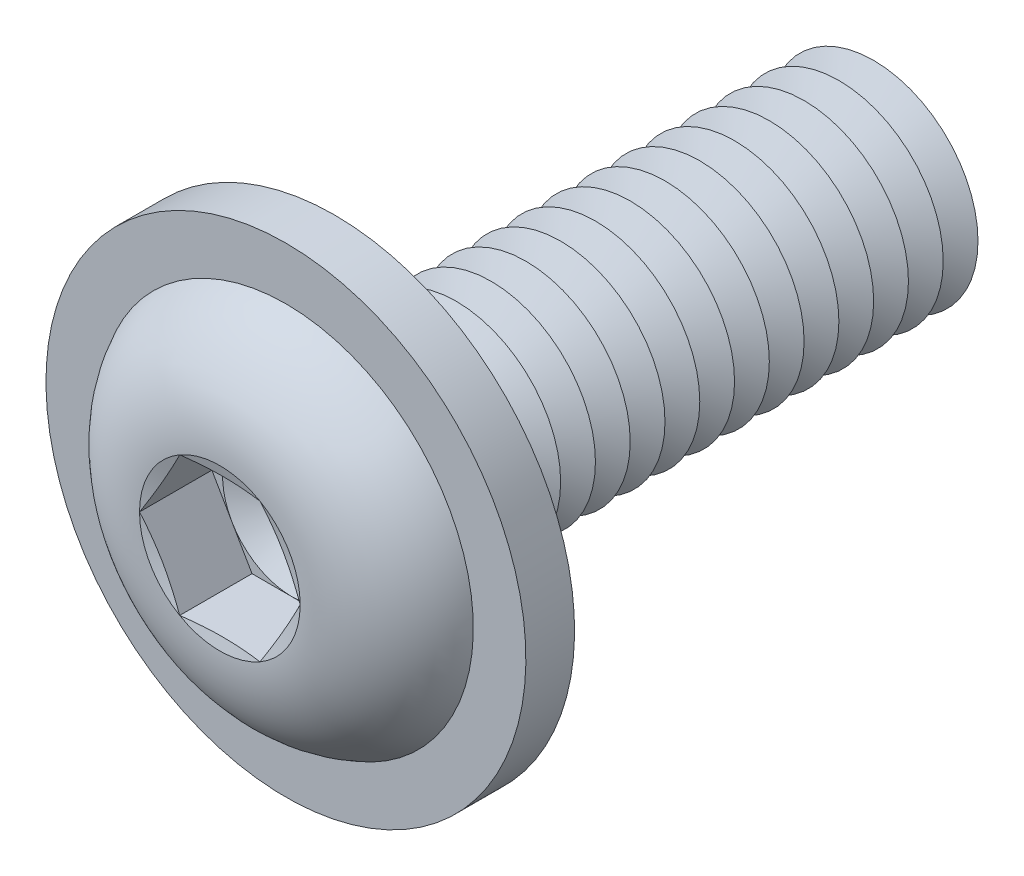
ISO-10303-21;
HEADER;
FILE_DESCRIPTION(('STEP AP214'),'2;1');
FILE_NAME('part.step','',(''),(''),'','','');
FILE_SCHEMA(('AUTOMOTIVE_DESIGN { 1 0 10303 214 1 1 1 1 }'));
ENDSEC;
DATA;
#1=APPLICATION_CONTEXT('core data for automotive mechanical design processes');
#2=APPLICATION_PROTOCOL_DEFINITION('international standard','automotive_design',2000,#1);
#3=PRODUCT_CONTEXT('',#1,'mechanical');
#4=PRODUCT('Part','Part','',(#3));
#5=PRODUCT_RELATED_PRODUCT_CATEGORY('part','',(#4));
#6=PRODUCT_DEFINITION_FORMATION('','',#4);
#7=PRODUCT_DEFINITION_CONTEXT('part definition',#1,'design');
#8=PRODUCT_DEFINITION('design','',#6,#7);
#9=PRODUCT_DEFINITION_SHAPE('','',#8);
#10=(LENGTH_UNIT() NAMED_UNIT(*) SI_UNIT(.MILLI.,.METRE.));
#11=(NAMED_UNIT(*) PLANE_ANGLE_UNIT() SI_UNIT($,.RADIAN.));
#12=(NAMED_UNIT(*) SI_UNIT($,.STERADIAN.) SOLID_ANGLE_UNIT());
#13=UNCERTAINTY_MEASURE_WITH_UNIT(LENGTH_MEASURE(1.E-05),#10,'distance_accuracy_value','');
#14=(GEOMETRIC_REPRESENTATION_CONTEXT(3) GLOBAL_UNCERTAINTY_ASSIGNED_CONTEXT((#13)) GLOBAL_UNIT_ASSIGNED_CONTEXT((#10,
#11,#12)) REPRESENTATION_CONTEXT('',''));
#15=CARTESIAN_POINT('',(0.,0.,0.));
#16=DIRECTION('',(0.,0.,1.));
#17=DIRECTION('',(1.,0.,0.));
#18=AXIS2_PLACEMENT_3D('',#15,#16,#17);
#19=CARTESIAN_POINT('',(0.,0.,-6.25));
#20=DIRECTION('',(0.,0.,1.));
#21=DIRECTION('',(1.,0.,0.));
#22=AXIS2_PLACEMENT_3D('',#19,#20,#21);
#23=CONICAL_SURFACE('',#22,1.5,1.0471975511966);
#24=CARTESIAN_POINT('',(0.,0.,-6.5));
#25=DIRECTION('',(0.,0.,1.));
#26=DIRECTION('',(1.,0.,0.));
#27=AXIS2_PLACEMENT_3D('',#24,#25,#26);
#28=CIRCLE('',#27,1.06698729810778);
#29=CARTESIAN_POINT('',(1.06698729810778,0.,-6.5));
#30=VERTEX_POINT('',#29);
#31=EDGE_CURVE('E339',#30,#30,#28,.T.);
#32=ORIENTED_EDGE('',*,*,#31,.T.);
#33=EDGE_LOOP('',(#32));
#34=FACE_BOUND('',#33,.T.);
#35=CARTESIAN_POINT('',(0.,0.,-6.25));
#36=DIRECTION('',(0.,0.,1.));
#37=DIRECTION('',(1.,0.,0.));
#38=AXIS2_PLACEMENT_3D('',#35,#36,#37);
#39=CIRCLE('',#38,1.5);
#40=CARTESIAN_POINT('',(1.5,0.,-6.25));
#41=VERTEX_POINT('',#40);
#42=EDGE_CURVE('E335',#41,#41,#39,.T.);
#43=ORIENTED_EDGE('',*,*,#42,.F.);
#44=EDGE_LOOP('',(#43));
#45=FACE_BOUND('',#44,.T.);
#46=ADVANCED_FACE('F39',(#34,#45),#23,.T.);
#47=CARTESIAN_POINT('',(0.,0.,-6.5));
#48=DIRECTION('',(0.,0.,-1.));
#49=DIRECTION('',(-1.,0.,0.));
#50=AXIS2_PLACEMENT_3D('',#47,#48,#49);
#51=CONICAL_SURFACE('',#50,1.06698729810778,1.0471975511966);
#52=CARTESIAN_POINT('',(0.,0.,-6.75));
#53=DIRECTION('',(0.,0.,1.));
#54=DIRECTION('',(1.,0.,0.));
#55=AXIS2_PLACEMENT_3D('',#52,#53,#54);
#56=CIRCLE('',#55,1.5);
#57=CARTESIAN_POINT('',(1.5,0.,-6.75));
#58=VERTEX_POINT('',#57);
#59=EDGE_CURVE('E343',#58,#58,#56,.T.);
#60=ORIENTED_EDGE('',*,*,#59,.T.);
#61=EDGE_LOOP('',(#60));
#62=FACE_BOUND('',#61,.T.);
#63=ORIENTED_EDGE('',*,*,#31,.F.);
#64=EDGE_LOOP('',(#63));
#65=FACE_BOUND('',#64,.T.);
#66=ADVANCED_FACE('F464',(#62,#65),#51,.T.);
#67=CARTESIAN_POINT('',(0.,1.5,-8.));
#68=DIRECTION('',(0.,0.,-1.));
#69=DIRECTION('',(-1.,0.,0.));
#70=AXIS2_PLACEMENT_3D('',#67,#68,#69);
#71=PLANE('',#70);
#72=CARTESIAN_POINT('',(0.,0.,-8.));
#73=DIRECTION('',(0.,0.,1.));
#74=DIRECTION('',(1.,0.,0.));
#75=AXIS2_PLACEMENT_3D('',#72,#73,#74);
#76=CIRCLE('',#75,1.06698729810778);
#77=CARTESIAN_POINT('',(1.06698729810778,0.,-8.));
#78=VERTEX_POINT('',#77);
#79=EDGE_CURVE('E363',#78,#78,#76,.T.);
#80=ORIENTED_EDGE('',*,*,#79,.F.);
#81=EDGE_LOOP('',(#80));
#82=FACE_BOUND('',#81,.T.);
#83=ADVANCED_FACE('F470',(#82),#71,.T.);
#84=CARTESIAN_POINT('',(0.,0.,-7.75));
#85=DIRECTION('',(0.,0.,1.));
#86=DIRECTION('',(1.,0.,0.));
#87=AXIS2_PLACEMENT_3D('',#84,#85,#86);
#88=CONICAL_SURFACE('',#87,1.5,1.0471975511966);
#89=ORIENTED_EDGE('',*,*,#79,.T.);
#90=EDGE_LOOP('',(#89));
#91=FACE_BOUND('',#90,.T.);
#92=CARTESIAN_POINT('',(0.,0.,-7.75));
#93=DIRECTION('',(0.,0.,1.));
#94=DIRECTION('',(1.,0.,0.));
#95=AXIS2_PLACEMENT_3D('',#92,#93,#94);
#96=CIRCLE('',#95,1.5);
#97=CARTESIAN_POINT('',(1.5,0.,-7.75));
#98=VERTEX_POINT('',#97);
#99=EDGE_CURVE('E359',#98,#98,#96,.T.);
#100=ORIENTED_EDGE('',*,*,#99,.F.);
#101=EDGE_LOOP('',(#100));
#102=FACE_BOUND('',#101,.T.);
#103=ADVANCED_FACE('F489',(#91,#102),#88,.T.);
#104=CARTESIAN_POINT('',(0.,0.,-7.5));
#105=DIRECTION('',(0.,0.,-1.));
#106=DIRECTION('',(-1.,0.,0.));
#107=AXIS2_PLACEMENT_3D('',#104,#105,#106);
#108=CONICAL_SURFACE('',#107,1.06698729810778,1.0471975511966);
#109=ORIENTED_EDGE('',*,*,#99,.T.);
#110=EDGE_LOOP('',(#109));
#111=FACE_BOUND('',#110,.T.);
#112=CARTESIAN_POINT('',(0.,0.,-7.5));
#113=DIRECTION('',(0.,0.,1.));
#114=DIRECTION('',(1.,0.,0.));
#115=AXIS2_PLACEMENT_3D('',#112,#113,#114);
#116=CIRCLE('',#115,1.06698729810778);
#117=CARTESIAN_POINT('',(1.06698729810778,0.,-7.5));
#118=VERTEX_POINT('',#117);
#119=EDGE_CURVE('E355',#118,#118,#116,.T.);
#120=ORIENTED_EDGE('',*,*,#119,.F.);
#121=EDGE_LOOP('',(#120));
#122=FACE_BOUND('',#121,.T.);
#123=ADVANCED_FACE('F486',(#111,#122),#108,.T.);
#124=CARTESIAN_POINT('',(0.,0.,-7.25));
#125=DIRECTION('',(0.,0.,1.));
#126=DIRECTION('',(1.,0.,0.));
#127=AXIS2_PLACEMENT_3D('',#124,#125,#126);
#128=CONICAL_SURFACE('',#127,1.5,1.0471975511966);
#129=ORIENTED_EDGE('',*,*,#119,.T.);
#130=EDGE_LOOP('',(#129));
#131=FACE_BOUND('',#130,.T.);
#132=CARTESIAN_POINT('',(0.,0.,-7.25));
#133=DIRECTION('',(0.,0.,1.));
#134=DIRECTION('',(1.,0.,0.));
#135=AXIS2_PLACEMENT_3D('',#132,#133,#134);
#136=CIRCLE('',#135,1.5);
#137=CARTESIAN_POINT('',(1.5,0.,-7.25));
#138=VERTEX_POINT('',#137);
#139=EDGE_CURVE('E351',#138,#138,#136,.T.);
#140=ORIENTED_EDGE('',*,*,#139,.F.);
#141=EDGE_LOOP('',(#140));
#142=FACE_BOUND('',#141,.T.);
#143=ADVANCED_FACE('F480',(#131,#142),#128,.T.);
#144=CARTESIAN_POINT('',(0.,0.,-7.));
#145=DIRECTION('',(0.,0.,-1.));
#146=DIRECTION('',(-1.,0.,0.));
#147=AXIS2_PLACEMENT_3D('',#144,#145,#146);
#148=CONICAL_SURFACE('',#147,1.06698729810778,1.0471975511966);
#149=ORIENTED_EDGE('',*,*,#139,.T.);
#150=EDGE_LOOP('',(#149));
#151=FACE_BOUND('',#150,.T.);
#152=CARTESIAN_POINT('',(0.,0.,-7.));
#153=DIRECTION('',(0.,0.,1.));
#154=DIRECTION('',(1.,0.,0.));
#155=AXIS2_PLACEMENT_3D('',#152,#153,#154);
#156=CIRCLE('',#155,1.06698729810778);
#157=CARTESIAN_POINT('',(1.06698729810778,0.,-7.));
#158=VERTEX_POINT('',#157);
#159=EDGE_CURVE('E347',#158,#158,#156,.T.);
#160=ORIENTED_EDGE('',*,*,#159,.F.);
#161=EDGE_LOOP('',(#160));
#162=FACE_BOUND('',#161,.T.);
#163=ADVANCED_FACE('F476',(#151,#162),#148,.T.);
#164=CARTESIAN_POINT('',(0.,0.,-6.75));
#165=DIRECTION('',(0.,0.,1.));
#166=DIRECTION('',(1.,0.,0.));
#167=AXIS2_PLACEMENT_3D('',#164,#165,#166);
#168=CONICAL_SURFACE('',#167,1.5,1.0471975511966);
#169=ORIENTED_EDGE('',*,*,#159,.T.);
#170=EDGE_LOOP('',(#169));
#171=FACE_BOUND('',#170,.T.);
#172=ORIENTED_EDGE('',*,*,#59,.F.);
#173=EDGE_LOOP('',(#172));
#174=FACE_BOUND('',#173,.T.);
#175=ADVANCED_FACE('F479',(#171,#174),#168,.T.);
#176=CARTESIAN_POINT('',(0.,0.,-5.75));
#177=DIRECTION('',(0.,0.,1.));
#178=DIRECTION('',(1.,0.,0.));
#179=AXIS2_PLACEMENT_3D('',#176,#177,#178);
#180=CONICAL_SURFACE('',#179,1.5,1.0471975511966);
#181=CARTESIAN_POINT('',(0.,0.,-6.));
#182=DIRECTION('',(0.,0.,1.));
#183=DIRECTION('',(1.,0.,0.));
#184=AXIS2_PLACEMENT_3D('',#181,#182,#183);
#185=CIRCLE('',#184,1.06698729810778);
#186=CARTESIAN_POINT('',(1.06698729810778,0.,-6.));
#187=VERTEX_POINT('',#186);
#188=EDGE_CURVE('E331',#187,#187,#185,.T.);
#189=ORIENTED_EDGE('',*,*,#188,.T.);
#190=EDGE_LOOP('',(#189));
#191=FACE_BOUND('',#190,.T.);
#192=CARTESIAN_POINT('',(0.,0.,-5.75));
#193=DIRECTION('',(0.,0.,1.));
#194=DIRECTION('',(1.,0.,0.));
#195=AXIS2_PLACEMENT_3D('',#192,#193,#194);
#196=CIRCLE('',#195,1.5);
#197=CARTESIAN_POINT('',(1.5,0.,-5.75));
#198=VERTEX_POINT('',#197);
#199=EDGE_CURVE('E327',#198,#198,#196,.T.);
#200=ORIENTED_EDGE('',*,*,#199,.F.);
#201=EDGE_LOOP('',(#200));
#202=FACE_BOUND('',#201,.T.);
#203=ADVANCED_FACE('F484',(#191,#202),#180,.T.);
#204=CARTESIAN_POINT('',(0.,0.,-6.));
#205=DIRECTION('',(0.,0.,-1.));
#206=DIRECTION('',(-1.,0.,0.));
#207=AXIS2_PLACEMENT_3D('',#204,#205,#206);
#208=CONICAL_SURFACE('',#207,1.06698729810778,1.0471975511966);
#209=ORIENTED_EDGE('',*,*,#42,.T.);
#210=EDGE_LOOP('',(#209));
#211=FACE_BOUND('',#210,.T.);
#212=ORIENTED_EDGE('',*,*,#188,.F.);
#213=EDGE_LOOP('',(#212));
#214=FACE_BOUND('',#213,.T.);
#215=ADVANCED_FACE('F535',(#211,#214),#208,.T.);
#216=CARTESIAN_POINT('',(0.,0.,-5.25));
#217=DIRECTION('',(0.,0.,1.));
#218=DIRECTION('',(1.,0.,0.));
#219=AXIS2_PLACEMENT_3D('',#216,#217,#218);
#220=CONICAL_SURFACE('',#219,1.5,1.0471975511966);
#221=CARTESIAN_POINT('',(0.,0.,-5.5));
#222=DIRECTION('',(0.,0.,1.));
#223=DIRECTION('',(1.,0.,0.));
#224=AXIS2_PLACEMENT_3D('',#221,#222,#223);
#225=CIRCLE('',#224,1.06698729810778);
#226=CARTESIAN_POINT('',(1.06698729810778,0.,-5.5));
#227=VERTEX_POINT('',#226);
#228=EDGE_CURVE('E323',#227,#227,#225,.T.);
#229=ORIENTED_EDGE('',*,*,#228,.T.);
#230=EDGE_LOOP('',(#229));
#231=FACE_BOUND('',#230,.T.);
#232=CARTESIAN_POINT('',(0.,0.,-5.25));
#233=DIRECTION('',(0.,0.,1.));
#234=DIRECTION('',(1.,0.,0.));
#235=AXIS2_PLACEMENT_3D('',#232,#233,#234);
#236=CIRCLE('',#235,1.5);
#237=CARTESIAN_POINT('',(1.5,0.,-5.25));
#238=VERTEX_POINT('',#237);
#239=EDGE_CURVE('E319',#238,#238,#236,.T.);
#240=ORIENTED_EDGE('',*,*,#239,.F.);
#241=EDGE_LOOP('',(#240));
#242=FACE_BOUND('',#241,.T.);
#243=ADVANCED_FACE('F541',(#231,#242),#220,.T.);
#244=CARTESIAN_POINT('',(0.,0.,-5.5));
#245=DIRECTION('',(0.,0.,-1.));
#246=DIRECTION('',(-1.,0.,0.));
#247=AXIS2_PLACEMENT_3D('',#244,#245,#246);
#248=CONICAL_SURFACE('',#247,1.06698729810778,1.0471975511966);
#249=ORIENTED_EDGE('',*,*,#199,.T.);
#250=EDGE_LOOP('',(#249));
#251=FACE_BOUND('',#250,.T.);
#252=ORIENTED_EDGE('',*,*,#228,.F.);
#253=EDGE_LOOP('',(#252));
#254=FACE_BOUND('',#253,.T.);
#255=ADVANCED_FACE('F548',(#251,#254),#248,.T.);
#256=CARTESIAN_POINT('',(0.,0.,-4.75));
#257=DIRECTION('',(0.,0.,1.));
#258=DIRECTION('',(1.,0.,0.));
#259=AXIS2_PLACEMENT_3D('',#256,#257,#258);
#260=CONICAL_SURFACE('',#259,1.5,1.0471975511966);
#261=CARTESIAN_POINT('',(0.,0.,-5.));
#262=DIRECTION('',(0.,0.,1.));
#263=DIRECTION('',(1.,0.,0.));
#264=AXIS2_PLACEMENT_3D('',#261,#262,#263);
#265=CIRCLE('',#264,1.06698729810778);
#266=CARTESIAN_POINT('',(1.06698729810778,0.,-5.));
#267=VERTEX_POINT('',#266);
#268=EDGE_CURVE('E315',#267,#267,#265,.T.);
#269=ORIENTED_EDGE('',*,*,#268,.T.);
#270=EDGE_LOOP('',(#269));
#271=FACE_BOUND('',#270,.T.);
#272=CARTESIAN_POINT('',(0.,0.,-4.75));
#273=DIRECTION('',(0.,0.,1.));
#274=DIRECTION('',(1.,0.,0.));
#275=AXIS2_PLACEMENT_3D('',#272,#273,#274);
#276=CIRCLE('',#275,1.5);
#277=CARTESIAN_POINT('',(1.5,0.,-4.75));
#278=VERTEX_POINT('',#277);
#279=EDGE_CURVE('E311',#278,#278,#276,.T.);
#280=ORIENTED_EDGE('',*,*,#279,.F.);
#281=EDGE_LOOP('',(#280));
#282=FACE_BOUND('',#281,.T.);
#283=ADVANCED_FACE('F555',(#271,#282),#260,.T.);
#284=CARTESIAN_POINT('',(0.,0.,-5.));
#285=DIRECTION('',(0.,0.,-1.));
#286=DIRECTION('',(-1.,0.,0.));
#287=AXIS2_PLACEMENT_3D('',#284,#285,#286);
#288=CONICAL_SURFACE('',#287,1.06698729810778,1.0471975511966);
#289=ORIENTED_EDGE('',*,*,#239,.T.);
#290=EDGE_LOOP('',(#289));
#291=FACE_BOUND('',#290,.T.);
#292=ORIENTED_EDGE('',*,*,#268,.F.);
#293=EDGE_LOOP('',(#292));
#294=FACE_BOUND('',#293,.T.);
#295=ADVANCED_FACE('F562',(#291,#294),#288,.T.);
#296=CARTESIAN_POINT('',(0.,0.,-4.25));
#297=DIRECTION('',(0.,0.,1.));
#298=DIRECTION('',(1.,0.,0.));
#299=AXIS2_PLACEMENT_3D('',#296,#297,#298);
#300=CONICAL_SURFACE('',#299,1.5,1.0471975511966);
#301=CARTESIAN_POINT('',(0.,0.,-4.5));
#302=DIRECTION('',(0.,0.,1.));
#303=DIRECTION('',(1.,0.,0.));
#304=AXIS2_PLACEMENT_3D('',#301,#302,#303);
#305=CIRCLE('',#304,1.06698729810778);
#306=CARTESIAN_POINT('',(1.06698729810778,0.,-4.5));
#307=VERTEX_POINT('',#306);
#308=EDGE_CURVE('E307',#307,#307,#305,.T.);
#309=ORIENTED_EDGE('',*,*,#308,.T.);
#310=EDGE_LOOP('',(#309));
#311=FACE_BOUND('',#310,.T.);
#312=CARTESIAN_POINT('',(0.,0.,-4.25));
#313=DIRECTION('',(0.,0.,1.));
#314=DIRECTION('',(1.,0.,0.));
#315=AXIS2_PLACEMENT_3D('',#312,#313,#314);
#316=CIRCLE('',#315,1.5);
#317=CARTESIAN_POINT('',(1.5,0.,-4.25));
#318=VERTEX_POINT('',#317);
#319=EDGE_CURVE('E303',#318,#318,#316,.T.);
#320=ORIENTED_EDGE('',*,*,#319,.F.);
#321=EDGE_LOOP('',(#320));
#322=FACE_BOUND('',#321,.T.);
#323=ADVANCED_FACE('F569',(#311,#322),#300,.T.);
#324=CARTESIAN_POINT('',(0.,0.,-4.5));
#325=DIRECTION('',(0.,0.,-1.));
#326=DIRECTION('',(-1.,0.,0.));
#327=AXIS2_PLACEMENT_3D('',#324,#325,#326);
#328=CONICAL_SURFACE('',#327,1.06698729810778,1.0471975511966);
#329=ORIENTED_EDGE('',*,*,#279,.T.);
#330=EDGE_LOOP('',(#329));
#331=FACE_BOUND('',#330,.T.);
#332=ORIENTED_EDGE('',*,*,#308,.F.);
#333=EDGE_LOOP('',(#332));
#334=FACE_BOUND('',#333,.T.);
#335=ADVANCED_FACE('F576',(#331,#334),#328,.T.);
#336=CARTESIAN_POINT('',(0.,0.,-3.75));
#337=DIRECTION('',(0.,0.,1.));
#338=DIRECTION('',(1.,0.,0.));
#339=AXIS2_PLACEMENT_3D('',#336,#337,#338);
#340=CONICAL_SURFACE('',#339,1.5,1.0471975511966);
#341=CARTESIAN_POINT('',(0.,0.,-4.));
#342=DIRECTION('',(0.,0.,1.));
#343=DIRECTION('',(1.,0.,0.));
#344=AXIS2_PLACEMENT_3D('',#341,#342,#343);
#345=CIRCLE('',#344,1.06698729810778);
#346=CARTESIAN_POINT('',(1.06698729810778,0.,-4.));
#347=VERTEX_POINT('',#346);
#348=EDGE_CURVE('E299',#347,#347,#345,.T.);
#349=ORIENTED_EDGE('',*,*,#348,.T.);
#350=EDGE_LOOP('',(#349));
#351=FACE_BOUND('',#350,.T.);
#352=CARTESIAN_POINT('',(0.,0.,-3.75));
#353=DIRECTION('',(0.,0.,1.));
#354=DIRECTION('',(1.,0.,0.));
#355=AXIS2_PLACEMENT_3D('',#352,#353,#354);
#356=CIRCLE('',#355,1.5);
#357=CARTESIAN_POINT('',(1.5,0.,-3.75));
#358=VERTEX_POINT('',#357);
#359=EDGE_CURVE('E295',#358,#358,#356,.T.);
#360=ORIENTED_EDGE('',*,*,#359,.F.);
#361=EDGE_LOOP('',(#360));
#362=FACE_BOUND('',#361,.T.);
#363=ADVANCED_FACE('F583',(#351,#362),#340,.T.);
#364=CARTESIAN_POINT('',(0.,0.,-4.));
#365=DIRECTION('',(0.,0.,-1.));
#366=DIRECTION('',(-1.,0.,0.));
#367=AXIS2_PLACEMENT_3D('',#364,#365,#366);
#368=CONICAL_SURFACE('',#367,1.06698729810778,1.0471975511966);
#369=ORIENTED_EDGE('',*,*,#319,.T.);
#370=EDGE_LOOP('',(#369));
#371=FACE_BOUND('',#370,.T.);
#372=ORIENTED_EDGE('',*,*,#348,.F.);
#373=EDGE_LOOP('',(#372));
#374=FACE_BOUND('',#373,.T.);
#375=ADVANCED_FACE('F590',(#371,#374),#368,.T.);
#376=CARTESIAN_POINT('',(0.,0.,-3.25));
#377=DIRECTION('',(0.,0.,1.));
#378=DIRECTION('',(1.,0.,0.));
#379=AXIS2_PLACEMENT_3D('',#376,#377,#378);
#380=CONICAL_SURFACE('',#379,1.5,1.0471975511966);
#381=CARTESIAN_POINT('',(0.,0.,-3.5));
#382=DIRECTION('',(0.,0.,1.));
#383=DIRECTION('',(1.,0.,0.));
#384=AXIS2_PLACEMENT_3D('',#381,#382,#383);
#385=CIRCLE('',#384,1.06698729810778);
#386=CARTESIAN_POINT('',(1.06698729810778,0.,-3.5));
#387=VERTEX_POINT('',#386);
#388=EDGE_CURVE('E291',#387,#387,#385,.T.);
#389=ORIENTED_EDGE('',*,*,#388,.T.);
#390=EDGE_LOOP('',(#389));
#391=FACE_BOUND('',#390,.T.);
#392=CARTESIAN_POINT('',(0.,0.,-3.25));
#393=DIRECTION('',(0.,0.,1.));
#394=DIRECTION('',(1.,0.,0.));
#395=AXIS2_PLACEMENT_3D('',#392,#393,#394);
#396=CIRCLE('',#395,1.5);
#397=CARTESIAN_POINT('',(1.5,0.,-3.25));
#398=VERTEX_POINT('',#397);
#399=EDGE_CURVE('E287',#398,#398,#396,.T.);
#400=ORIENTED_EDGE('',*,*,#399,.F.);
#401=EDGE_LOOP('',(#400));
#402=FACE_BOUND('',#401,.T.);
#403=ADVANCED_FACE('F597',(#391,#402),#380,.T.);
#404=CARTESIAN_POINT('',(0.,0.,-3.5));
#405=DIRECTION('',(0.,0.,-1.));
#406=DIRECTION('',(-1.,0.,0.));
#407=AXIS2_PLACEMENT_3D('',#404,#405,#406);
#408=CONICAL_SURFACE('',#407,1.06698729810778,1.0471975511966);
#409=ORIENTED_EDGE('',*,*,#359,.T.);
#410=EDGE_LOOP('',(#409));
#411=FACE_BOUND('',#410,.T.);
#412=ORIENTED_EDGE('',*,*,#388,.F.);
#413=EDGE_LOOP('',(#412));
#414=FACE_BOUND('',#413,.T.);
#415=ADVANCED_FACE('F604',(#411,#414),#408,.T.);
#416=CARTESIAN_POINT('',(0.,0.,-2.75));
#417=DIRECTION('',(0.,0.,1.));
#418=DIRECTION('',(1.,0.,0.));
#419=AXIS2_PLACEMENT_3D('',#416,#417,#418);
#420=CONICAL_SURFACE('',#419,1.5,1.0471975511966);
#421=CARTESIAN_POINT('',(0.,0.,-3.));
#422=DIRECTION('',(0.,0.,1.));
#423=DIRECTION('',(1.,0.,0.));
#424=AXIS2_PLACEMENT_3D('',#421,#422,#423);
#425=CIRCLE('',#424,1.06698729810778);
#426=CARTESIAN_POINT('',(1.06698729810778,0.,-3.));
#427=VERTEX_POINT('',#426);
#428=EDGE_CURVE('E283',#427,#427,#425,.T.);
#429=ORIENTED_EDGE('',*,*,#428,.T.);
#430=EDGE_LOOP('',(#429));
#431=FACE_BOUND('',#430,.T.);
#432=CARTESIAN_POINT('',(0.,0.,-2.75));
#433=DIRECTION('',(0.,0.,1.));
#434=DIRECTION('',(1.,0.,0.));
#435=AXIS2_PLACEMENT_3D('',#432,#433,#434);
#436=CIRCLE('',#435,1.5);
#437=CARTESIAN_POINT('',(1.5,0.,-2.75));
#438=VERTEX_POINT('',#437);
#439=EDGE_CURVE('E279',#438,#438,#436,.T.);
#440=ORIENTED_EDGE('',*,*,#439,.F.);
#441=EDGE_LOOP('',(#440));
#442=FACE_BOUND('',#441,.T.);
#443=ADVANCED_FACE('F611',(#431,#442),#420,.T.);
#444=CARTESIAN_POINT('',(0.,0.,-3.));
#445=DIRECTION('',(0.,0.,-1.));
#446=DIRECTION('',(-1.,0.,0.));
#447=AXIS2_PLACEMENT_3D('',#444,#445,#446);
#448=CONICAL_SURFACE('',#447,1.06698729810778,1.0471975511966);
#449=ORIENTED_EDGE('',*,*,#399,.T.);
#450=EDGE_LOOP('',(#449));
#451=FACE_BOUND('',#450,.T.);
#452=ORIENTED_EDGE('',*,*,#428,.F.);
#453=EDGE_LOOP('',(#452));
#454=FACE_BOUND('',#453,.T.);
#455=ADVANCED_FACE('F618',(#451,#454),#448,.T.);
#456=CARTESIAN_POINT('',(0.,0.,-2.25));
#457=DIRECTION('',(0.,0.,1.));
#458=DIRECTION('',(1.,0.,0.));
#459=AXIS2_PLACEMENT_3D('',#456,#457,#458);
#460=CONICAL_SURFACE('',#459,1.5,1.0471975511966);
#461=CARTESIAN_POINT('',(0.,0.,-2.5));
#462=DIRECTION('',(0.,0.,1.));
#463=DIRECTION('',(1.,0.,0.));
#464=AXIS2_PLACEMENT_3D('',#461,#462,#463);
#465=CIRCLE('',#464,1.06698729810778);
#466=CARTESIAN_POINT('',(1.06698729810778,0.,-2.5));
#467=VERTEX_POINT('',#466);
#468=EDGE_CURVE('E275',#467,#467,#465,.T.);
#469=ORIENTED_EDGE('',*,*,#468,.T.);
#470=EDGE_LOOP('',(#469));
#471=FACE_BOUND('',#470,.T.);
#472=CARTESIAN_POINT('',(0.,0.,-2.25));
#473=DIRECTION('',(0.,0.,1.));
#474=DIRECTION('',(1.,0.,0.));
#475=AXIS2_PLACEMENT_3D('',#472,#473,#474);
#476=CIRCLE('',#475,1.5);
#477=CARTESIAN_POINT('',(1.5,0.,-2.25));
#478=VERTEX_POINT('',#477);
#479=EDGE_CURVE('E271',#478,#478,#476,.T.);
#480=ORIENTED_EDGE('',*,*,#479,.F.);
#481=EDGE_LOOP('',(#480));
#482=FACE_BOUND('',#481,.T.);
#483=ADVANCED_FACE('F625',(#471,#482),#460,.T.);
#484=CARTESIAN_POINT('',(0.,0.,-2.5));
#485=DIRECTION('',(0.,0.,-1.));
#486=DIRECTION('',(-1.,0.,0.));
#487=AXIS2_PLACEMENT_3D('',#484,#485,#486);
#488=CONICAL_SURFACE('',#487,1.06698729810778,1.0471975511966);
#489=ORIENTED_EDGE('',*,*,#439,.T.);
#490=EDGE_LOOP('',(#489));
#491=FACE_BOUND('',#490,.T.);
#492=ORIENTED_EDGE('',*,*,#468,.F.);
#493=EDGE_LOOP('',(#492));
#494=FACE_BOUND('',#493,.T.);
#495=ADVANCED_FACE('F632',(#491,#494),#488,.T.);
#496=CARTESIAN_POINT('',(0.,0.,-1.75));
#497=DIRECTION('',(0.,0.,1.));
#498=DIRECTION('',(1.,0.,0.));
#499=AXIS2_PLACEMENT_3D('',#496,#497,#498);
#500=CONICAL_SURFACE('',#499,1.5,1.0471975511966);
#501=CARTESIAN_POINT('',(0.,0.,-2.));
#502=DIRECTION('',(0.,0.,1.));
#503=DIRECTION('',(1.,0.,0.));
#504=AXIS2_PLACEMENT_3D('',#501,#502,#503);
#505=CIRCLE('',#504,1.06698729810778);
#506=CARTESIAN_POINT('',(1.06698729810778,0.,-2.));
#507=VERTEX_POINT('',#506);
#508=EDGE_CURVE('E267',#507,#507,#505,.T.);
#509=ORIENTED_EDGE('',*,*,#508,.T.);
#510=EDGE_LOOP('',(#509));
#511=FACE_BOUND('',#510,.T.);
#512=CARTESIAN_POINT('',(0.,0.,-1.75));
#513=DIRECTION('',(0.,0.,1.));
#514=DIRECTION('',(1.,0.,0.));
#515=AXIS2_PLACEMENT_3D('',#512,#513,#514);
#516=CIRCLE('',#515,1.5);
#517=CARTESIAN_POINT('',(1.5,0.,-1.75));
#518=VERTEX_POINT('',#517);
#519=EDGE_CURVE('E263',#518,#518,#516,.T.);
#520=ORIENTED_EDGE('',*,*,#519,.F.);
#521=EDGE_LOOP('',(#520));
#522=FACE_BOUND('',#521,.T.);
#523=ADVANCED_FACE('F639',(#511,#522),#500,.T.);
#524=CARTESIAN_POINT('',(0.,0.,-2.));
#525=DIRECTION('',(0.,0.,-1.));
#526=DIRECTION('',(-1.,0.,0.));
#527=AXIS2_PLACEMENT_3D('',#524,#525,#526);
#528=CONICAL_SURFACE('',#527,1.06698729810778,1.0471975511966);
#529=ORIENTED_EDGE('',*,*,#479,.T.);
#530=EDGE_LOOP('',(#529));
#531=FACE_BOUND('',#530,.T.);
#532=ORIENTED_EDGE('',*,*,#508,.F.);
#533=EDGE_LOOP('',(#532));
#534=FACE_BOUND('',#533,.T.);
#535=ADVANCED_FACE('F646',(#531,#534),#528,.T.);
#536=CARTESIAN_POINT('',(0.,0.,-1.25));
#537=DIRECTION('',(0.,0.,1.));
#538=DIRECTION('',(1.,0.,0.));
#539=AXIS2_PLACEMENT_3D('',#536,#537,#538);
#540=CONICAL_SURFACE('',#539,1.5,1.0471975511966);
#541=CARTESIAN_POINT('',(0.,0.,-1.5));
#542=DIRECTION('',(0.,0.,1.));
#543=DIRECTION('',(1.,0.,0.));
#544=AXIS2_PLACEMENT_3D('',#541,#542,#543);
#545=CIRCLE('',#544,1.06698729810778);
#546=CARTESIAN_POINT('',(1.06698729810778,0.,-1.5));
#547=VERTEX_POINT('',#546);
#548=EDGE_CURVE('E259',#547,#547,#545,.T.);
#549=ORIENTED_EDGE('',*,*,#548,.T.);
#550=EDGE_LOOP('',(#549));
#551=FACE_BOUND('',#550,.T.);
#552=CARTESIAN_POINT('',(0.,0.,-1.25));
#553=DIRECTION('',(0.,0.,1.));
#554=DIRECTION('',(1.,0.,0.));
#555=AXIS2_PLACEMENT_3D('',#552,#553,#554);
#556=CIRCLE('',#555,1.5);
#557=CARTESIAN_POINT('',(1.5,0.,-1.25));
#558=VERTEX_POINT('',#557);
#559=EDGE_CURVE('E255',#558,#558,#556,.T.);
#560=ORIENTED_EDGE('',*,*,#559,.F.);
#561=EDGE_LOOP('',(#560));
#562=FACE_BOUND('',#561,.T.);
#563=ADVANCED_FACE('F653',(#551,#562),#540,.T.);
#564=CARTESIAN_POINT('',(0.,0.,-1.5));
#565=DIRECTION('',(0.,0.,-1.));
#566=DIRECTION('',(-1.,0.,0.));
#567=AXIS2_PLACEMENT_3D('',#564,#565,#566);
#568=CONICAL_SURFACE('',#567,1.06698729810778,1.0471975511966);
#569=ORIENTED_EDGE('',*,*,#519,.T.);
#570=EDGE_LOOP('',(#569));
#571=FACE_BOUND('',#570,.T.);
#572=ORIENTED_EDGE('',*,*,#548,.F.);
#573=EDGE_LOOP('',(#572));
#574=FACE_BOUND('',#573,.T.);
#575=ADVANCED_FACE('F660',(#571,#574),#568,.T.);
#576=CARTESIAN_POINT('',(0.,0.,-0.75));
#577=DIRECTION('',(0.,0.,1.));
#578=DIRECTION('',(1.,0.,0.));
#579=AXIS2_PLACEMENT_3D('',#576,#577,#578);
#580=CONICAL_SURFACE('',#579,1.5,1.0471975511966);
#581=CARTESIAN_POINT('',(0.,0.,-1.));
#582=DIRECTION('',(0.,0.,1.));
#583=DIRECTION('',(1.,0.,0.));
#584=AXIS2_PLACEMENT_3D('',#581,#582,#583);
#585=CIRCLE('',#584,1.06698729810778);
#586=CARTESIAN_POINT('',(1.06698729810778,0.,-1.));
#587=VERTEX_POINT('',#586);
#588=EDGE_CURVE('E251',#587,#587,#585,.T.);
#589=ORIENTED_EDGE('',*,*,#588,.T.);
#590=EDGE_LOOP('',(#589));
#591=FACE_BOUND('',#590,.T.);
#592=CARTESIAN_POINT('',(0.,0.,-0.750000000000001));
#593=DIRECTION('',(0.,0.,1.));
#594=DIRECTION('',(1.,0.,0.));
#595=AXIS2_PLACEMENT_3D('',#592,#593,#594);
#596=CIRCLE('',#595,1.5);
#597=CARTESIAN_POINT('',(1.5,0.,-0.750000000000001));
#598=VERTEX_POINT('',#597);
#599=EDGE_CURVE('E243',#598,#598,#596,.T.);
#600=ORIENTED_EDGE('',*,*,#599,.F.);
#601=EDGE_LOOP('',(#600));
#602=FACE_BOUND('',#601,.T.);
#603=ADVANCED_FACE('F667',(#591,#602),#580,.T.);
#604=CARTESIAN_POINT('',(0.,0.,-1.));
#605=DIRECTION('',(0.,0.,-1.));
#606=DIRECTION('',(-1.,0.,0.));
#607=AXIS2_PLACEMENT_3D('',#604,#605,#606);
#608=CONICAL_SURFACE('',#607,1.06698729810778,1.0471975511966);
#609=ORIENTED_EDGE('',*,*,#559,.T.);
#610=EDGE_LOOP('',(#609));
#611=FACE_BOUND('',#610,.T.);
#612=ORIENTED_EDGE('',*,*,#588,.F.);
#613=EDGE_LOOP('',(#612));
#614=FACE_BOUND('',#613,.T.);
#615=ADVANCED_FACE('F674',(#611,#614),#608,.T.);
#616=CARTESIAN_POINT('',(0.,0.,-0.25));
#617=DIRECTION('',(0.,0.,1.));
#618=DIRECTION('',(1.,0.,0.));
#619=AXIS2_PLACEMENT_3D('',#616,#617,#618);
#620=CONICAL_SURFACE('',#619,1.5,1.0471975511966);
#621=CARTESIAN_POINT('',(0.,0.,-0.5));
#622=DIRECTION('',(0.,0.,1.));
#623=DIRECTION('',(1.,0.,0.));
#624=AXIS2_PLACEMENT_3D('',#621,#622,#623);
#625=CIRCLE('',#624,1.06698729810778);
#626=CARTESIAN_POINT('',(1.06698729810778,0.,-0.5));
#627=VERTEX_POINT('',#626);
#628=EDGE_CURVE('E232',#627,#627,#625,.T.);
#629=ORIENTED_EDGE('',*,*,#628,.T.);
#630=EDGE_LOOP('',(#629));
#631=FACE_BOUND('',#630,.T.);
#632=CARTESIAN_POINT('',(0.,0.,-0.25));
#633=DIRECTION('',(0.,0.,1.));
#634=DIRECTION('',(1.,0.,0.));
#635=AXIS2_PLACEMENT_3D('',#632,#633,#634);
#636=CIRCLE('',#635,1.5);
#637=CARTESIAN_POINT('',(1.5,0.,-0.25));
#638=VERTEX_POINT('',#637);
#639=EDGE_CURVE('E247',#638,#638,#636,.T.);
#640=ORIENTED_EDGE('',*,*,#639,.F.);
#641=EDGE_LOOP('',(#640));
#642=FACE_BOUND('',#641,.T.);
#643=ADVANCED_FACE('F681',(#631,#642),#620,.T.);
#644=CARTESIAN_POINT('',(0.,0.,-0.5));
#645=DIRECTION('',(0.,0.,-1.));
#646=DIRECTION('',(-1.,0.,0.));
#647=AXIS2_PLACEMENT_3D('',#644,#645,#646);
#648=CONICAL_SURFACE('',#647,1.06698729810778,1.0471975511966);
#649=ORIENTED_EDGE('',*,*,#599,.T.);
#650=EDGE_LOOP('',(#649));
#651=FACE_BOUND('',#650,.T.);
#652=ORIENTED_EDGE('',*,*,#628,.F.);
#653=EDGE_LOOP('',(#652));
#654=FACE_BOUND('',#653,.T.);
#655=ADVANCED_FACE('F221',(#651,#654),#648,.T.);
#656=CARTESIAN_POINT('',(0.,1.5,0.));
#657=DIRECTION('',(0.,0.,-1.));
#658=DIRECTION('',(-1.,0.,0.));
#659=AXIS2_PLACEMENT_3D('',#656,#657,#658);
#660=PLANE('',#659);
#661=CARTESIAN_POINT('',(0.,0.,0.));
#662=DIRECTION('',(0.,0.,-1.));
#663=DIRECTION('',(-1.,0.,0.));
#664=AXIS2_PLACEMENT_3D('',#661,#662,#663);
#665=CIRCLE('',#664,1.75);
#666=CARTESIAN_POINT('',(-1.75,0.,0.));
#667=VERTEX_POINT('',#666);
#668=EDGE_CURVE('E372',#667,#667,#665,.F.);
#669=ORIENTED_EDGE('',*,*,#668,.T.);
#670=EDGE_LOOP('',(#669));
#671=FACE_BOUND('',#670,.T.);
#672=CARTESIAN_POINT('',(0.,0.,0.));
#673=DIRECTION('',(0.,0.,-1.));
#674=DIRECTION('',(0.,1.,0.));
#675=AXIS2_PLACEMENT_3D('',#672,#673,#674);
#676=CIRCLE('',#675,3.45);
#677=CARTESIAN_POINT('',(0.,3.45,0.));
#678=VERTEX_POINT('',#677);
#679=EDGE_CURVE('E1037',#678,#678,#676,.T.);
#680=ORIENTED_EDGE('',*,*,#679,.T.);
#681=EDGE_LOOP('',(#680));
#682=FACE_BOUND('',#681,.T.);
#683=ADVANCED_FACE('F693',(#671,#682),#660,.T.);
#684=CARTESIAN_POINT('',(0.,0.,-0.25));
#685=DIRECTION('',(0.,0.,-1.));
#686=DIRECTION('',(-1.,0.,0.));
#687=AXIS2_PLACEMENT_3D('',#684,#685,#686);
#688=TOROIDAL_SURFACE('',#687,1.75,0.25);
#689=ORIENTED_EDGE('',*,*,#668,.F.);
#690=EDGE_LOOP('',(#689));
#691=FACE_BOUND('',#690,.T.);
#692=ORIENTED_EDGE('',*,*,#639,.T.);
#693=EDGE_LOOP('',(#692));
#694=FACE_BOUND('',#693,.T.);
#695=ADVANCED_FACE('F41',(#691,#694),#688,.F.);
#696=CARTESIAN_POINT('',(0.,0.,0.7));
#697=DIRECTION('',(0.,0.,-1.));
#698=DIRECTION('',(0.,1.,0.));
#699=AXIS2_PLACEMENT_3D('',#696,#697,#698);
#700=CYLINDRICAL_SURFACE('',#699,3.45);
#701=CARTESIAN_POINT('',(0.,0.,0.7));
#702=DIRECTION('',(0.,0.,-1.));
#703=DIRECTION('',(0.,1.,0.));
#704=AXIS2_PLACEMENT_3D('',#701,#702,#703);
#705=CIRCLE('',#704,3.45);
#706=CARTESIAN_POINT('',(0.,3.45,0.7));
#707=VERTEX_POINT('',#706);
#708=EDGE_CURVE('E1036',#707,#707,#705,.T.);
#709=ORIENTED_EDGE('',*,*,#708,.T.);
#710=EDGE_LOOP('',(#709));
#711=FACE_BOUND('',#710,.T.);
#712=ORIENTED_EDGE('',*,*,#679,.F.);
#713=EDGE_LOOP('',(#712));
#714=FACE_BOUND('',#713,.T.);
#715=ADVANCED_FACE('F704',(#711,#714),#700,.T.);
#716=CARTESIAN_POINT('',(0.,0.,0.7));
#717=DIRECTION('',(0.,0.,-1.));
#718=DIRECTION('',(0.,1.,0.));
#719=AXIS2_PLACEMENT_3D('',#716,#717,#718);
#720=PLANE('',#719);
#721=CARTESIAN_POINT('',(0.,0.,0.7));
#722=DIRECTION('',(0.,0.,-1.));
#723=DIRECTION('',(0.,1.,0.));
#724=AXIS2_PLACEMENT_3D('',#721,#722,#723);
#725=CIRCLE('',#724,2.69421838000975);
#726=CARTESIAN_POINT('',(0.,2.69421838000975,0.7));
#727=VERTEX_POINT('',#726);
#728=EDGE_CURVE('E43',#727,#727,#725,.F.);
#729=ORIENTED_EDGE('',*,*,#728,.F.);
#730=EDGE_LOOP('',(#729));
#731=FACE_BOUND('',#730,.T.);
#732=ORIENTED_EDGE('',*,*,#708,.F.);
#733=EDGE_LOOP('',(#732));
#734=FACE_BOUND('',#733,.T.);
#735=ADVANCED_FACE('F117',(#731,#734),#720,.F.);
#736=CARTESIAN_POINT('',(0.,0.,0.609999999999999));
#737=DIRECTION('',(0.,0.,1.));
#738=DIRECTION('',(1.,0.,0.));
#739=AXIS2_PLACEMENT_3D('',#736,#737,#738);
#740=CONICAL_SURFACE('',#739,0.99999953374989,1.0471975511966);
#741=CARTESIAN_POINT('',(0.,0.,0.0326500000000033));
#742=VERTEX_POINT('',#741);
#743=VERTEX_LOOP('',#742);
#744=FACE_BOUND('',#743,.T.);
#745=CARTESIAN_POINT('',(0.,0.,0.609999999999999));
#746=DIRECTION('',(0.,0.,1.));
#747=DIRECTION('',(1.,0.,0.));
#748=AXIS2_PLACEMENT_3D('',#745,#746,#747);
#749=CIRCLE('',#748,0.99999953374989);
#750=CARTESIAN_POINT('',(0.866024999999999,0.499999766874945,0.609999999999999));
#751=VERTEX_POINT('',#750);
#752=CARTESIAN_POINT('',(0.,0.99999953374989,0.609999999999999));
#753=VERTEX_POINT('',#752);
#754=EDGE_CURVE('E120',#751,#753,#749,.T.);
#755=ORIENTED_EDGE('',*,*,#754,.T.);
#756=CARTESIAN_POINT('',(0.,0.,0.609999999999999));
#757=DIRECTION('',(0.,0.,1.));
#758=DIRECTION('',(1.,0.,0.));
#759=AXIS2_PLACEMENT_3D('',#756,#757,#758);
#760=CIRCLE('',#759,0.99999953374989);
#761=CARTESIAN_POINT('',(-0.866024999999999,0.499999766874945,0.609999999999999));
#762=VERTEX_POINT('',#761);
#763=EDGE_CURVE('E11',#753,#762,#760,.T.);
#764=ORIENTED_EDGE('',*,*,#763,.T.);
#765=CARTESIAN_POINT('',(-0.866024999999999,-0.499999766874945,0.609999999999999));
#766=VERTEX_POINT('',#765);
#767=EDGE_CURVE('E49',#762,#766,#760,.T.);
#768=ORIENTED_EDGE('',*,*,#767,.T.);
#769=CARTESIAN_POINT('',(0.,-0.99999953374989,0.609999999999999));
#770=VERTEX_POINT('',#769);
#771=EDGE_CURVE('E378',#766,#770,#760,.T.);
#772=ORIENTED_EDGE('',*,*,#771,.T.);
#773=CARTESIAN_POINT('',(0.866024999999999,-0.499999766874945,0.609999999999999));
#774=VERTEX_POINT('',#773);
#775=EDGE_CURVE('E57',#770,#774,#760,.T.);
#776=ORIENTED_EDGE('',*,*,#775,.T.);
#777=EDGE_CURVE('E50',#774,#751,#760,.T.);
#778=ORIENTED_EDGE('',*,*,#777,.T.);
#779=EDGE_LOOP('',(#755,#764,#768,#772,#776,#778));
#780=FACE_BOUND('',#779,.T.);
#781=ADVANCED_FACE('F114',(#744,#780),#740,.F.);
#782=CARTESIAN_POINT('',(0.,0.,0.609999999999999));
#783=DIRECTION('',(0.,0.,1.));
#784=DIRECTION('',(1.,0.,0.));
#785=AXIS2_PLACEMENT_3D('',#782,#783,#784);
#786=PLANE('',#785);
#787=ORIENTED_EDGE('',*,*,#771,.F.);
#788=DIRECTION('',(0.5,-0.866025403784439,0.));
#789=VECTOR('',#788,1.);
#790=CARTESIAN_POINT('',(-1.1547,0.,0.609999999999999));
#791=LINE('',#790,#789);
#792=CARTESIAN_POINT('',(-0.577349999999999,-0.99999953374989,0.609999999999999));
#793=VERTEX_POINT('',#792);
#794=EDGE_CURVE('E154',#766,#793,#791,.T.);
#795=ORIENTED_EDGE('',*,*,#794,.T.);
#796=DIRECTION('',(1.,0.,0.));
#797=VECTOR('',#796,1.);
#798=CARTESIAN_POINT('',(-0.577349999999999,-0.99999953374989,0.609999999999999));
#799=LINE('',#798,#797);
#800=EDGE_CURVE('E160',#793,#770,#799,.T.);
#801=ORIENTED_EDGE('',*,*,#800,.T.);
#802=EDGE_LOOP('',(#787,#795,#801));
#803=FACE_BOUND('',#802,.T.);
#804=ADVANCED_FACE('F116',(#803),#786,.T.);
#805=ORIENTED_EDGE('',*,*,#775,.F.);
#806=CARTESIAN_POINT('',(0.577349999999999,-0.99999953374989,0.609999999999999));
#807=VERTEX_POINT('',#806);
#808=EDGE_CURVE('E159',#770,#807,#799,.T.);
#809=ORIENTED_EDGE('',*,*,#808,.T.);
#810=DIRECTION('',(0.5,0.866025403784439,0.));
#811=VECTOR('',#810,1.);
#812=CARTESIAN_POINT('',(0.577349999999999,-0.99999953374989,0.609999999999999));
#813=LINE('',#812,#811);
#814=EDGE_CURVE('E165',#807,#774,#813,.T.);
#815=ORIENTED_EDGE('',*,*,#814,.T.);
#816=EDGE_LOOP('',(#805,#809,#815));
#817=FACE_BOUND('',#816,.T.);
#818=ADVANCED_FACE('F456',(#817),#786,.T.);
#819=ORIENTED_EDGE('',*,*,#777,.F.);
#820=CARTESIAN_POINT('',(1.1547,0.,0.609999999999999));
#821=VERTEX_POINT('',#820);
#822=EDGE_CURVE('E164',#774,#821,#813,.T.);
#823=ORIENTED_EDGE('',*,*,#822,.T.);
#824=DIRECTION('',(-0.5,0.866025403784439,0.));
#825=VECTOR('',#824,1.);
#826=CARTESIAN_POINT('',(1.1547,0.,0.609999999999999));
#827=LINE('',#826,#825);
#828=EDGE_CURVE('E142',#821,#751,#827,.T.);
#829=ORIENTED_EDGE('',*,*,#828,.T.);
#830=EDGE_LOOP('',(#819,#823,#829));
#831=FACE_BOUND('',#830,.T.);
#832=ADVANCED_FACE('F436',(#831),#786,.T.);
#833=ORIENTED_EDGE('',*,*,#754,.F.);
#834=CARTESIAN_POINT('',(0.577349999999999,0.99999953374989,0.609999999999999));
#835=VERTEX_POINT('',#834);
#836=EDGE_CURVE('E127',#751,#835,#827,.T.);
#837=ORIENTED_EDGE('',*,*,#836,.T.);
#838=DIRECTION('',(-1.,0.,0.));
#839=VECTOR('',#838,1.);
#840=CARTESIAN_POINT('',(0.577349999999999,0.99999953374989,0.609999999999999));
#841=LINE('',#840,#839);
#842=EDGE_CURVE('E138',#835,#753,#841,.T.);
#843=ORIENTED_EDGE('',*,*,#842,.T.);
#844=EDGE_LOOP('',(#833,#837,#843));
#845=FACE_BOUND('',#844,.T.);
#846=ADVANCED_FACE('F144',(#845),#786,.T.);
#847=ORIENTED_EDGE('',*,*,#763,.F.);
#848=CARTESIAN_POINT('',(-0.577350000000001,0.999999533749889,0.609999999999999));
#849=VERTEX_POINT('',#848);
#850=EDGE_CURVE('E133',#753,#849,#841,.T.);
#851=ORIENTED_EDGE('',*,*,#850,.T.);
#852=DIRECTION('',(-0.5,-0.866025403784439,0.));
#853=VECTOR('',#852,1.);
#854=CARTESIAN_POINT('',(-0.577350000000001,0.999999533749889,0.609999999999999));
#855=LINE('',#854,#853);
#856=EDGE_CURVE('E136',#849,#762,#855,.T.);
#857=ORIENTED_EDGE('',*,*,#856,.T.);
#858=EDGE_LOOP('',(#847,#851,#857));
#859=FACE_BOUND('',#858,.T.);
#860=ADVANCED_FACE('F132',(#859),#786,.T.);
#861=ORIENTED_EDGE('',*,*,#767,.F.);
#862=CARTESIAN_POINT('',(-1.1547,0.,0.609999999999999));
#863=VERTEX_POINT('',#862);
#864=EDGE_CURVE('E146',#762,#863,#855,.T.);
#865=ORIENTED_EDGE('',*,*,#864,.T.);
#866=EDGE_CURVE('E155',#863,#766,#791,.T.);
#867=ORIENTED_EDGE('',*,*,#866,.T.);
#868=EDGE_LOOP('',(#861,#865,#867));
#869=FACE_BOUND('',#868,.T.);
#870=ADVANCED_FACE('F392',(#869),#786,.T.);
#871=CARTESIAN_POINT('',(-1.1547,0.,0.609999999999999));
#872=DIRECTION('',(-0.866025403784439,-0.5,0.));
#873=DIRECTION('',(0.5,-0.866025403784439,0.));
#874=AXIS2_PLACEMENT_3D('',#871,#872,#873);
#875=PLANE('',#874);
#876=CARTESIAN_POINT('',(-1.15481547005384,0.000200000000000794,1.65003094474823));
#877=CARTESIAN_POINT('',(-1.13083002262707,-0.0413440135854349,1.64359970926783));
#878=CARTESIAN_POINT('',(-1.10680107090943,-0.0829633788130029,1.63776108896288));
#879=CARTESIAN_POINT('',(-1.05865826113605,-0.166349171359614,1.62750303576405));
#880=CARTESIAN_POINT('',(-1.03454437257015,-0.208115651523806,1.62308418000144));
#881=CARTESIAN_POINT('',(-0.986377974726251,-0.291542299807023,1.61592375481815));
#882=CARTESIAN_POINT('',(-0.962325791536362,-0.333201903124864,1.61317364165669));
#883=CARTESIAN_POINT('',(-0.914190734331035,-0.416574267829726,1.60948600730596));
#884=CARTESIAN_POINT('',(-0.890107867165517,-0.458287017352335,1.60854813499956));
#885=CARTESIAN_POINT('',(-0.841942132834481,-0.541712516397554,1.60854813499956));
#886=CARTESIAN_POINT('',(-0.817859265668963,-0.583425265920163,1.60948600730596));
#887=CARTESIAN_POINT('',(-0.769724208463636,-0.666797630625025,1.61317364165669));
#888=CARTESIAN_POINT('',(-0.745672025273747,-0.708457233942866,1.61592375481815));
#889=CARTESIAN_POINT('',(-0.697505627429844,-0.791883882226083,1.62308418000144));
#890=CARTESIAN_POINT('',(-0.673391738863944,-0.833650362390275,1.62750303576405));
#891=CARTESIAN_POINT('',(-0.625248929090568,-0.917036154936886,1.63776108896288));
#892=CARTESIAN_POINT('',(-0.60121997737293,-0.958655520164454,1.64359970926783));
#893=CARTESIAN_POINT('',(-0.577234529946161,-1.00019953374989,1.65003094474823));
#894=B_SPLINE_CURVE_WITH_KNOTS('',3,(#876,#877,#878,#879,#880,#881,#882,#883,#884,#885,#886,
#887,#888,#889,#890,#891,#892,#893),.UNSPECIFIED.,.F.,.F.,(4,2,2,2,2,2,2,2,4),(0.,
0.145207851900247,0.290474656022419,0.434991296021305,0.579479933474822,0.723968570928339,
0.868485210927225,1.0137520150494,1.15895986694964),.UNSPECIFIED.);
#895=CARTESIAN_POINT('',(-1.1547,0.,1.65));
#896=VERTEX_POINT('',#895);
#897=CARTESIAN_POINT('',(-0.577349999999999,-0.99999953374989,1.65));
#898=VERTEX_POINT('',#897);
#899=EDGE_CURVE('E397',#896,#898,#894,.T.);
#900=ORIENTED_EDGE('',*,*,#899,.T.);
#901=DIRECTION('',(0.,0.,1.));
#902=VECTOR('',#901,1.);
#903=CARTESIAN_POINT('',(-0.577349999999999,-0.99999953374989,0.609999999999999));
#904=LINE('',#903,#902);
#905=EDGE_CURVE('E178',#793,#898,#904,.T.);
#906=ORIENTED_EDGE('',*,*,#905,.F.);
#907=ORIENTED_EDGE('',*,*,#794,.F.);
#908=ORIENTED_EDGE('',*,*,#866,.F.);
#909=DIRECTION('',(0.,0.,1.));
#910=VECTOR('',#909,1.);
#911=CARTESIAN_POINT('',(-1.1547,0.,0.609999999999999));
#912=LINE('',#911,#910);
#913=EDGE_CURVE('E182',#863,#896,#912,.T.);
#914=ORIENTED_EDGE('',*,*,#913,.T.);
#915=EDGE_LOOP('',(#900,#906,#907,#908,#914));
#916=FACE_BOUND('',#915,.T.);
#917=ADVANCED_FACE('F390',(#916),#875,.F.);
#918=CARTESIAN_POINT('',(-0.577349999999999,-0.99999953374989,0.609999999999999));
#919=DIRECTION('',(0.,-1.,0.));
#920=DIRECTION('',(0.,0.,-1.));
#921=AXIS2_PLACEMENT_3D('',#918,#919,#920);
#922=PLANE('',#921);
#923=CARTESIAN_POINT('',(-1.7425668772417,-0.99999953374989,1.87893949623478));
#924=CARTESIAN_POINT('',(-1.65819693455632,-0.99999953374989,1.85935934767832));
#925=CARTESIAN_POINT('',(-1.57375647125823,-0.99999953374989,1.84006351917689));
#926=CARTESIAN_POINT('',(-1.40464514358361,-0.99999953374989,1.80242908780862));
#927=CARTESIAN_POINT('',(-1.31997423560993,-0.99999953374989,1.78409068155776));
#928=CARTESIAN_POINT('',(-1.14955192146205,-0.99999953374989,1.74860242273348));
#929=CARTESIAN_POINT('',(-1.06379782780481,-0.99999953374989,1.73146532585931));
#930=CARTESIAN_POINT('',(-0.891887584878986,-0.99999953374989,1.69925819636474));
#931=CARTESIAN_POINT('',(-0.805731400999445,-0.99999953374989,1.68418834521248));
#932=CARTESIAN_POINT('',(-0.635256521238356,-0.99999953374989,1.65751615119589));
#933=CARTESIAN_POINT('',(-0.550951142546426,-0.99999953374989,1.64583105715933));
#934=CARTESIAN_POINT('',(-0.381865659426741,-0.99999953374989,1.62668811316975));
#935=CARTESIAN_POINT('',(-0.297085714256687,-0.99999953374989,1.61922892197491));
#936=CARTESIAN_POINT('',(-0.127577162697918,-0.99999953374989,1.60981453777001));
#937=CARTESIAN_POINT('',(-0.0428499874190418,-0.99999953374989,1.60783514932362));
#938=CARTESIAN_POINT('',(0.126542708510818,-0.99999953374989,1.60973012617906));
#939=CARTESIAN_POINT('',(0.211208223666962,-0.99999953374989,1.61360496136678));
#940=CARTESIAN_POINT('',(0.35611534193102,-0.99999953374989,1.62460226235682));
#941=CARTESIAN_POINT('',(0.416458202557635,-0.99999953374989,1.63048841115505));
#942=CARTESIAN_POINT('',(0.536893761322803,-0.99999953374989,1.64437752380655));
#943=CARTESIAN_POINT('',(0.596986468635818,-0.99999953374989,1.65238040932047));
#944=CARTESIAN_POINT('',(0.777275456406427,-0.99999953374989,1.67888855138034));
#945=CARTESIAN_POINT('',(0.897104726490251,-0.99999953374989,1.69985858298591));
#946=CARTESIAN_POINT('',(1.07751611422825,-0.99999953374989,1.73433574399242));
#947=CARTESIAN_POINT('',(1.1383777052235,-0.99999953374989,1.74646914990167));
#948=CARTESIAN_POINT('',(1.25994955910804,-0.99999953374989,1.7714845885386));
#949=CARTESIAN_POINT('',(1.32065982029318,-0.99999953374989,1.78436662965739));
#950=CARTESIAN_POINT('',(1.44162663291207,-0.99999953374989,1.81062164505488));
#951=CARTESIAN_POINT('',(1.50188385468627,-0.99999953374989,1.82399156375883));
#952=CARTESIAN_POINT('',(1.62229550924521,-0.99999953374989,1.85116781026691));
#953=CARTESIAN_POINT('',(1.68244994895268,-0.99999953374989,1.86497410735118));
#954=CARTESIAN_POINT('',(1.7425668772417,-0.99999953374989,1.87893949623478));
#955=B_SPLINE_CURVE_WITH_KNOTS('',3,(#923,#924,#925,#926,#927,#928,#929,#930,#931,#932,#933,
#934,#935,#936,#937,#938,#939,#940,#941,#942,#943,#944,#945,#946,#947,#948,#949,#950,#951,#952,
#953,#954),.UNSPECIFIED.,.F.,.F.,(4,2,2,2,2,2,2,2,2,2,2,2,2,2,2,4),(0.,0.259842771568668,
0.519738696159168,0.782071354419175,1.04442702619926,1.29968778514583,1.55486748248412,
1.80891865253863,2.06299021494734,2.24483732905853,2.42667771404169,2.79149503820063,
2.97767344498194,3.16385393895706,3.34902052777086,3.53417411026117),.UNSPECIFIED.);
#956=CARTESIAN_POINT('',(0.577349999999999,-0.99999953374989,1.65));
#957=VERTEX_POINT('',#956);
#958=EDGE_CURVE('E404',#898,#957,#955,.T.);
#959=ORIENTED_EDGE('',*,*,#958,.T.);
#960=DIRECTION('',(0.,0.,1.));
#961=VECTOR('',#960,1.);
#962=CARTESIAN_POINT('',(0.577349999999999,-0.99999953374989,0.609999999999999));
#963=LINE('',#962,#961);
#964=EDGE_CURVE('E174',#807,#957,#963,.T.);
#965=ORIENTED_EDGE('',*,*,#964,.F.);
#966=ORIENTED_EDGE('',*,*,#808,.F.);
#967=ORIENTED_EDGE('',*,*,#800,.F.);
#968=ORIENTED_EDGE('',*,*,#905,.T.);
#969=EDGE_LOOP('',(#959,#965,#966,#967,#968));
#970=FACE_BOUND('',#969,.T.);
#971=ADVANCED_FACE('F452',(#970),#922,.F.);
#972=CARTESIAN_POINT('',(0.577349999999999,-0.99999953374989,0.609999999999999));
#973=DIRECTION('',(0.866025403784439,-0.5,0.));
#974=DIRECTION('',(0.5,0.866025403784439,0.));
#975=AXIS2_PLACEMENT_3D('',#972,#973,#974);
#976=PLANE('',#975);
#977=CARTESIAN_POINT('',(0.577234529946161,-1.00019953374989,1.65003094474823));
#978=CARTESIAN_POINT('',(0.60121997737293,-0.958655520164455,1.64359970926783));
#979=CARTESIAN_POINT('',(0.625248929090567,-0.917036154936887,1.63776108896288));
#980=CARTESIAN_POINT('',(0.673391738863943,-0.833650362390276,1.62750303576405));
#981=CARTESIAN_POINT('',(0.697505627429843,-0.791883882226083,1.62308418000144));
#982=CARTESIAN_POINT('',(0.745672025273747,-0.708457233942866,1.61592375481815));
#983=CARTESIAN_POINT('',(0.769724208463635,-0.666797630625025,1.61317364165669));
#984=CARTESIAN_POINT('',(0.817859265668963,-0.583425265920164,1.60948600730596));
#985=CARTESIAN_POINT('',(0.84194213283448,-0.541712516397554,1.60854813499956));
#986=CARTESIAN_POINT('',(0.890107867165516,-0.458287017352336,1.60854813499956));
#987=CARTESIAN_POINT('',(0.914190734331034,-0.416574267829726,1.60948600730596));
#988=CARTESIAN_POINT('',(0.962325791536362,-0.333201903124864,1.61317364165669));
#989=CARTESIAN_POINT('',(0.98637797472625,-0.291542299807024,1.61592375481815));
#990=CARTESIAN_POINT('',(1.03454437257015,-0.208115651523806,1.62308418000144));
#991=CARTESIAN_POINT('',(1.05865826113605,-0.166349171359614,1.62750303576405));
#992=CARTESIAN_POINT('',(1.10680107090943,-0.0829633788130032,1.63776108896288));
#993=CARTESIAN_POINT('',(1.13083002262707,-0.0413440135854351,1.64359970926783));
#994=CARTESIAN_POINT('',(1.15481547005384,0.000200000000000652,1.65003094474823));
#995=B_SPLINE_CURVE_WITH_KNOTS('',3,(#977,#978,#979,#980,#981,#982,#983,#984,#985,#986,#987,
#988,#989,#990,#991,#992,#993,#994),.UNSPECIFIED.,.F.,.F.,(4,2,2,2,2,2,2,2,4),(0.,
0.145207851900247,0.290474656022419,0.434991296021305,0.579479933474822,0.723968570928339,
0.868485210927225,1.0137520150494,1.15895986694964),.UNSPECIFIED.);
#996=CARTESIAN_POINT('',(1.1547,0.,1.65));
#997=VERTEX_POINT('',#996);
#998=EDGE_CURVE('E233',#957,#997,#995,.T.);
#999=ORIENTED_EDGE('',*,*,#998,.T.);
#1000=DIRECTION('',(0.,0.,1.));
#1001=VECTOR('',#1000,1.);
#1002=CARTESIAN_POINT('',(1.1547,0.,0.609999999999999));
#1003=LINE('',#1002,#1001);
#1004=EDGE_CURVE('E169',#821,#997,#1003,.T.);
#1005=ORIENTED_EDGE('',*,*,#1004,.F.);
#1006=ORIENTED_EDGE('',*,*,#822,.F.);
#1007=ORIENTED_EDGE('',*,*,#814,.F.);
#1008=ORIENTED_EDGE('',*,*,#964,.T.);
#1009=EDGE_LOOP('',(#999,#1005,#1006,#1007,#1008));
#1010=FACE_BOUND('',#1009,.T.);
#1011=ADVANCED_FACE('F219',(#1010),#976,.F.);
#1012=CARTESIAN_POINT('',(1.1547,0.,0.609999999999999));
#1013=DIRECTION('',(0.866025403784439,0.5,0.));
#1014=DIRECTION('',(-0.5,0.866025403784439,0.));
#1015=AXIS2_PLACEMENT_3D('',#1012,#1013,#1014);
#1016=PLANE('',#1015);
#1017=CARTESIAN_POINT('',(1.15481547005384,-0.000199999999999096,1.65003094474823));
#1018=CARTESIAN_POINT('',(1.13083002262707,0.0413440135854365,1.64359970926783));
#1019=CARTESIAN_POINT('',(1.10680107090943,0.0829633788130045,1.63776108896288));
#1020=CARTESIAN_POINT('',(1.05865826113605,0.166349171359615,1.62750303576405));
#1021=CARTESIAN_POINT('',(1.03454437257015,0.208115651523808,1.62308418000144));
#1022=CARTESIAN_POINT('',(0.986377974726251,0.291542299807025,1.61592375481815));
#1023=CARTESIAN_POINT('',(0.962325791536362,0.333201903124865,1.61317364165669));
#1024=CARTESIAN_POINT('',(0.914190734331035,0.416574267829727,1.60948600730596));
#1025=CARTESIAN_POINT('',(0.890107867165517,0.458287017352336,1.60854813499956));
#1026=CARTESIAN_POINT('',(0.841942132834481,0.541712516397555,1.60854813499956));
#1027=CARTESIAN_POINT('',(0.817859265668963,0.583425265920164,1.60948600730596));
#1028=CARTESIAN_POINT('',(0.769724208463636,0.666797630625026,1.61317364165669));
#1029=CARTESIAN_POINT('',(0.745672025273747,0.708457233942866,1.61592375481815));
#1030=CARTESIAN_POINT('',(0.697505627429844,0.791883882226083,1.62308418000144));
#1031=CARTESIAN_POINT('',(0.673391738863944,0.833650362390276,1.62750303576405));
#1032=CARTESIAN_POINT('',(0.625248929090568,0.917036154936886,1.63776108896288));
#1033=CARTESIAN_POINT('',(0.60121997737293,0.958655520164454,1.64359970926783));
#1034=CARTESIAN_POINT('',(0.577234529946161,1.00019953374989,1.65003094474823));
#1035=B_SPLINE_CURVE_WITH_KNOTS('',3,(#1017,#1018,#1019,#1020,#1021,#1022,#1023,#1024,#1025,
#1026,#1027,#1028,#1029,#1030,#1031,#1032,#1033,#1034),.UNSPECIFIED.,.F.,.F.,(4,2,2,2,2,2,2,2,
4),(0.,0.145207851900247,0.290474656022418,0.434991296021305,0.579479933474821,
0.723968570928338,0.868485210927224,1.0137520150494,1.15895986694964),.UNSPECIFIED.);
#1036=CARTESIAN_POINT('',(0.577349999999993,0.999999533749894,1.65));
#1037=VERTEX_POINT('',#1036);
#1038=EDGE_CURVE('E224',#997,#1037,#1035,.T.);
#1039=ORIENTED_EDGE('',*,*,#1038,.T.);
#1040=DIRECTION('',(0.,0.,1.));
#1041=VECTOR('',#1040,1.);
#1042=CARTESIAN_POINT('',(0.577349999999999,0.99999953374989,0.609999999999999));
#1043=LINE('',#1042,#1041);
#1044=EDGE_CURVE('E65',#835,#1037,#1043,.T.);
#1045=ORIENTED_EDGE('',*,*,#1044,.F.);
#1046=ORIENTED_EDGE('',*,*,#836,.F.);
#1047=ORIENTED_EDGE('',*,*,#828,.F.);
#1048=ORIENTED_EDGE('',*,*,#1004,.T.);
#1049=EDGE_LOOP('',(#1039,#1045,#1046,#1047,#1048));
#1050=FACE_BOUND('',#1049,.T.);
#1051=ADVANCED_FACE('F213',(#1050),#1016,.F.);
#1052=CARTESIAN_POINT('',(0.577349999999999,0.99999953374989,0.609999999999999));
#1053=DIRECTION('',(0.,1.,0.));
#1054=DIRECTION('',(-1.,0.,0.));
#1055=AXIS2_PLACEMENT_3D('',#1052,#1053,#1054);
#1056=PLANE('',#1055);
#1057=CARTESIAN_POINT('',(1.7425668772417,0.99999953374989,1.87893949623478));
#1058=CARTESIAN_POINT('',(1.65819693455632,0.999999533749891,1.85935934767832));
#1059=CARTESIAN_POINT('',(1.57375647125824,0.99999953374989,1.84006351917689));
#1060=CARTESIAN_POINT('',(1.40464514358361,0.99999953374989,1.80242908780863));
#1061=CARTESIAN_POINT('',(1.31997423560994,0.99999953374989,1.78409068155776));
#1062=CARTESIAN_POINT('',(1.14955192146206,0.99999953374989,1.74860242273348));
#1063=CARTESIAN_POINT('',(1.06379782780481,0.99999953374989,1.73146532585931));
#1064=CARTESIAN_POINT('',(0.891887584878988,0.99999953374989,1.69925819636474));
#1065=CARTESIAN_POINT('',(0.805731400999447,0.99999953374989,1.68418834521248));
#1066=CARTESIAN_POINT('',(0.635256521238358,0.99999953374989,1.65751615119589));
#1067=CARTESIAN_POINT('',(0.550951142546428,0.99999953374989,1.64583105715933));
#1068=CARTESIAN_POINT('',(0.381865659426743,0.99999953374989,1.62668811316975));
#1069=CARTESIAN_POINT('',(0.297085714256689,0.99999953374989,1.61922892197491));
#1070=CARTESIAN_POINT('',(0.12757716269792,0.99999953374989,1.60981453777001));
#1071=CARTESIAN_POINT('',(0.0428499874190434,0.99999953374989,1.60783514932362));
#1072=CARTESIAN_POINT('',(-0.126542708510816,0.99999953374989,1.60973012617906));
#1073=CARTESIAN_POINT('',(-0.211208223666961,0.999999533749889,1.61360496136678));
#1074=CARTESIAN_POINT('',(-0.356115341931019,0.999999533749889,1.62460226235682));
#1075=CARTESIAN_POINT('',(-0.416458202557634,0.999999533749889,1.63048841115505));
#1076=CARTESIAN_POINT('',(-0.536893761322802,0.999999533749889,1.64437752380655));
#1077=CARTESIAN_POINT('',(-0.596986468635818,0.999999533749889,1.65238040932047));
#1078=CARTESIAN_POINT('',(-0.777275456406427,0.999999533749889,1.67888855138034));
#1079=CARTESIAN_POINT('',(-0.897104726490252,0.999999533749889,1.69985858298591));
#1080=CARTESIAN_POINT('',(-1.07751611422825,0.999999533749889,1.73433574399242));
#1081=CARTESIAN_POINT('',(-1.1383777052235,0.999999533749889,1.74646914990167));
#1082=CARTESIAN_POINT('',(-1.25994955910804,0.999999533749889,1.7714845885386));
#1083=CARTESIAN_POINT('',(-1.32065982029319,0.999999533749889,1.7843666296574));
#1084=CARTESIAN_POINT('',(-1.44162663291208,0.999999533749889,1.81062164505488));
#1085=CARTESIAN_POINT('',(-1.50188385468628,0.999999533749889,1.82399156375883));
#1086=CARTESIAN_POINT('',(-1.62229550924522,0.999999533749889,1.85116781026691));
#1087=CARTESIAN_POINT('',(-1.68244994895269,0.999999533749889,1.86497410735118));
#1088=CARTESIAN_POINT('',(-1.7425668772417,0.999999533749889,1.87893949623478));
#1089=B_SPLINE_CURVE_WITH_KNOTS('',3,(#1057,#1058,#1059,#1060,#1061,#1062,#1063,#1064,#1065,
#1066,#1067,#1068,#1069,#1070,#1071,#1072,#1073,#1074,#1075,#1076,#1077,#1078,#1079,#1080,#1081,
#1082,#1083,#1084,#1085,#1086,#1087,#1088),.UNSPECIFIED.,.F.,.F.,(4,2,2,2,2,2,2,2,2,2,2,2,2,2,2,
4),(0.,0.259842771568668,0.519738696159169,0.782071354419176,1.04442702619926,1.29968778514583,
1.55486748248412,1.80891865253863,2.06299021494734,2.24483732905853,2.42667771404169,
2.79149503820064,2.97767344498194,3.16385393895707,3.34902052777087,3.53417411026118),.UNSPECIFIED.);
#1090=CARTESIAN_POINT('',(-0.577350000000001,0.999999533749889,1.65));
#1091=VERTEX_POINT('',#1090);
#1092=EDGE_CURVE('E173',#1037,#1091,#1089,.T.);
#1093=ORIENTED_EDGE('',*,*,#1092,.T.);
#1094=DIRECTION('',(0.,0.,1.));
#1095=VECTOR('',#1094,1.);
#1096=CARTESIAN_POINT('',(-0.577350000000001,0.999999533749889,0.609999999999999));
#1097=LINE('',#1096,#1095);
#1098=EDGE_CURVE('E140',#849,#1091,#1097,.T.);
#1099=ORIENTED_EDGE('',*,*,#1098,.F.);
#1100=ORIENTED_EDGE('',*,*,#850,.F.);
#1101=ORIENTED_EDGE('',*,*,#842,.F.);
#1102=ORIENTED_EDGE('',*,*,#1044,.T.);
#1103=EDGE_LOOP('',(#1093,#1099,#1100,#1101,#1102));
#1104=FACE_BOUND('',#1103,.T.);
#1105=ADVANCED_FACE('F137',(#1104),#1056,.F.);
#1106=CARTESIAN_POINT('',(-0.577350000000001,0.999999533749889,0.609999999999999));
#1107=DIRECTION('',(-0.866025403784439,0.5,0.));
#1108=DIRECTION('',(-0.5,-0.866025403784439,0.));
#1109=AXIS2_PLACEMENT_3D('',#1106,#1107,#1108);
#1110=PLANE('',#1109);
#1111=CARTESIAN_POINT('',(-0.577234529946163,1.00019953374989,1.65003094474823));
#1112=CARTESIAN_POINT('',(-0.601219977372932,0.958655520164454,1.64359970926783));
#1113=CARTESIAN_POINT('',(-0.625248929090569,0.917036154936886,1.63776108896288));
#1114=CARTESIAN_POINT('',(-0.673391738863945,0.833650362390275,1.62750303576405));
#1115=CARTESIAN_POINT('',(-0.697505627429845,0.791883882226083,1.62308418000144));
#1116=CARTESIAN_POINT('',(-0.745672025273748,0.708457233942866,1.61592375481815));
#1117=CARTESIAN_POINT('',(-0.769724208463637,0.666797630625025,1.61317364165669));
#1118=CARTESIAN_POINT('',(-0.817859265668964,0.583425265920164,1.60948600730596));
#1119=CARTESIAN_POINT('',(-0.841942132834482,0.541712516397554,1.60854813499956));
#1120=CARTESIAN_POINT('',(-0.890107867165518,0.458287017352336,1.60854813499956));
#1121=CARTESIAN_POINT('',(-0.914190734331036,0.416574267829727,1.60948600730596));
#1122=CARTESIAN_POINT('',(-0.962325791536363,0.333201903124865,1.61317364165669));
#1123=CARTESIAN_POINT('',(-0.986377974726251,0.291542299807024,1.61592375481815));
#1124=CARTESIAN_POINT('',(-1.03454437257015,0.208115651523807,1.62308418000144));
#1125=CARTESIAN_POINT('',(-1.05865826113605,0.166349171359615,1.62750303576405));
#1126=CARTESIAN_POINT('',(-1.10680107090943,0.0829633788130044,1.63776108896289));
#1127=CARTESIAN_POINT('',(-1.13083002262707,0.0413440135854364,1.64359970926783));
#1128=CARTESIAN_POINT('',(-1.15481547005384,-0.000199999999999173,1.65003094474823));
#1129=B_SPLINE_CURVE_WITH_KNOTS('',3,(#1111,#1112,#1113,#1114,#1115,#1116,#1117,#1118,#1119,
#1120,#1121,#1122,#1123,#1124,#1125,#1126,#1127,#1128),.UNSPECIFIED.,.F.,.F.,(4,2,2,2,2,2,2,2,
4),(0.,0.145207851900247,0.290474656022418,0.434991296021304,0.579479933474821,
0.723968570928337,0.868485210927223,1.01375201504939,1.15895986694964),.UNSPECIFIED.);
#1130=EDGE_CURVE('E198',#1091,#896,#1129,.T.);
#1131=ORIENTED_EDGE('',*,*,#1130,.T.);
#1132=ORIENTED_EDGE('',*,*,#913,.F.);
#1133=ORIENTED_EDGE('',*,*,#864,.F.);
#1134=ORIENTED_EDGE('',*,*,#856,.F.);
#1135=ORIENTED_EDGE('',*,*,#1098,.T.);
#1136=EDGE_LOOP('',(#1131,#1132,#1133,#1134,#1135));
#1137=FACE_BOUND('',#1136,.T.);
#1138=ADVANCED_FACE('F212',(#1137),#1110,.F.);
#1139=CARTESIAN_POINT('',(0.,0.,1.65));
#1140=DIRECTION('',(0.,0.,1.));
#1141=DIRECTION('',(1.,0.,0.));
#1142=AXIS2_PLACEMENT_3D('',#1139,#1140,#1141);
#1143=CONICAL_SURFACE('',#1142,1.1547,1.30899693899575);
#1144=ORIENTED_EDGE('',*,*,#899,.F.);
#1145=CARTESIAN_POINT('',(0.,0.,1.65));
#1146=DIRECTION('',(0.,0.,-1.));
#1147=DIRECTION('',(-1.,0.,0.));
#1148=AXIS2_PLACEMENT_3D('',#1145,#1146,#1147);
#1149=CIRCLE('',#1148,1.1547);
#1150=EDGE_CURVE('E367',#898,#896,#1149,.T.);
#1151=ORIENTED_EDGE('',*,*,#1150,.F.);
#1152=EDGE_LOOP('',(#1144,#1151));
#1153=FACE_BOUND('',#1152,.T.);
#1154=ADVANCED_FACE('F401',(#1153),#1143,.F.);
#1155=ORIENTED_EDGE('',*,*,#958,.F.);
#1156=EDGE_CURVE('E412',#957,#898,#1149,.T.);
#1157=ORIENTED_EDGE('',*,*,#1156,.F.);
#1158=EDGE_LOOP('',(#1155,#1157));
#1159=FACE_BOUND('',#1158,.T.);
#1160=ADVANCED_FACE('F449',(#1159),#1143,.F.);
#1161=ORIENTED_EDGE('',*,*,#998,.F.);
#1162=EDGE_CURVE('E424',#997,#957,#1149,.T.);
#1163=ORIENTED_EDGE('',*,*,#1162,.F.);
#1164=EDGE_LOOP('',(#1161,#1163));
#1165=FACE_BOUND('',#1164,.T.);
#1166=ADVANCED_FACE('F444',(#1165),#1143,.F.);
#1167=ORIENTED_EDGE('',*,*,#1038,.F.);
#1168=EDGE_CURVE('E422',#1037,#997,#1149,.T.);
#1169=ORIENTED_EDGE('',*,*,#1168,.F.);
#1170=EDGE_LOOP('',(#1167,#1169));
#1171=FACE_BOUND('',#1170,.T.);
#1172=ADVANCED_FACE('F441',(#1171),#1143,.F.);
#1173=ORIENTED_EDGE('',*,*,#1092,.F.);
#1174=EDGE_CURVE('E373',#1091,#1037,#1149,.T.);
#1175=ORIENTED_EDGE('',*,*,#1174,.F.);
#1176=EDGE_LOOP('',(#1173,#1175));
#1177=FACE_BOUND('',#1176,.T.);
#1178=ADVANCED_FACE('F205',(#1177),#1143,.F.);
#1179=ORIENTED_EDGE('',*,*,#1130,.F.);
#1180=EDGE_CURVE('E368',#896,#1091,#1149,.T.);
#1181=ORIENTED_EDGE('',*,*,#1180,.F.);
#1182=EDGE_LOOP('',(#1179,#1181));
#1183=FACE_BOUND('',#1182,.T.);
#1184=ADVANCED_FACE('F414',(#1183),#1143,.F.);
#1185=CARTESIAN_POINT('',(0.,0.,0.));
#1186=DIRECTION('',(0.,0.,-1.));
#1187=DIRECTION('',(-1.,0.,0.));
#1188=AXIS2_PLACEMENT_3D('',#1185,#1186,#1187);
#1189=DEGENERATE_TOROIDAL_SURFACE('',#1188,1.19939477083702,1.65060522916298,.T.);
#1190=ORIENTED_EDGE('',*,*,#1180,.T.);
#1191=ORIENTED_EDGE('',*,*,#1174,.T.);
#1192=ORIENTED_EDGE('',*,*,#1168,.T.);
#1193=ORIENTED_EDGE('',*,*,#1162,.T.);
#1194=ORIENTED_EDGE('',*,*,#1156,.T.);
#1195=ORIENTED_EDGE('',*,*,#1150,.T.);
#1196=EDGE_LOOP('',(#1190,#1191,#1192,#1193,#1194,#1195));
#1197=FACE_BOUND('',#1196,.T.);
#1198=ORIENTED_EDGE('',*,*,#728,.T.);
#1199=EDGE_LOOP('',(#1198));
#1200=FACE_BOUND('',#1199,.T.);
#1201=ADVANCED_FACE('F407',(#1197,#1200),#1189,.T.);
#1202=CLOSED_SHELL('',(#46,#66,#83,#103,#123,#143,#163,#175,#203,#215,#243,#255,#283,#295,#323,
#335,#363,#375,#403,#415,#443,#455,#483,#495,#523,#535,#563,#575,#603,#615,#643,#655,#683,#695,
#715,#735,#781,#804,#818,#832,#846,#860,#870,#917,#971,#1011,#1051,#1105,#1138,#1154,#1160,
#1166,#1172,#1178,#1184,#1201));
#1203=MANIFOLD_SOLID_BREP('B2',#1202);
#1204=ADVANCED_BREP_SHAPE_REPRESENTATION('',(#18,#1203),#14);
#1205=SHAPE_DEFINITION_REPRESENTATION(#9,#1204);
ENDSEC;
END-ISO-10303-21;
